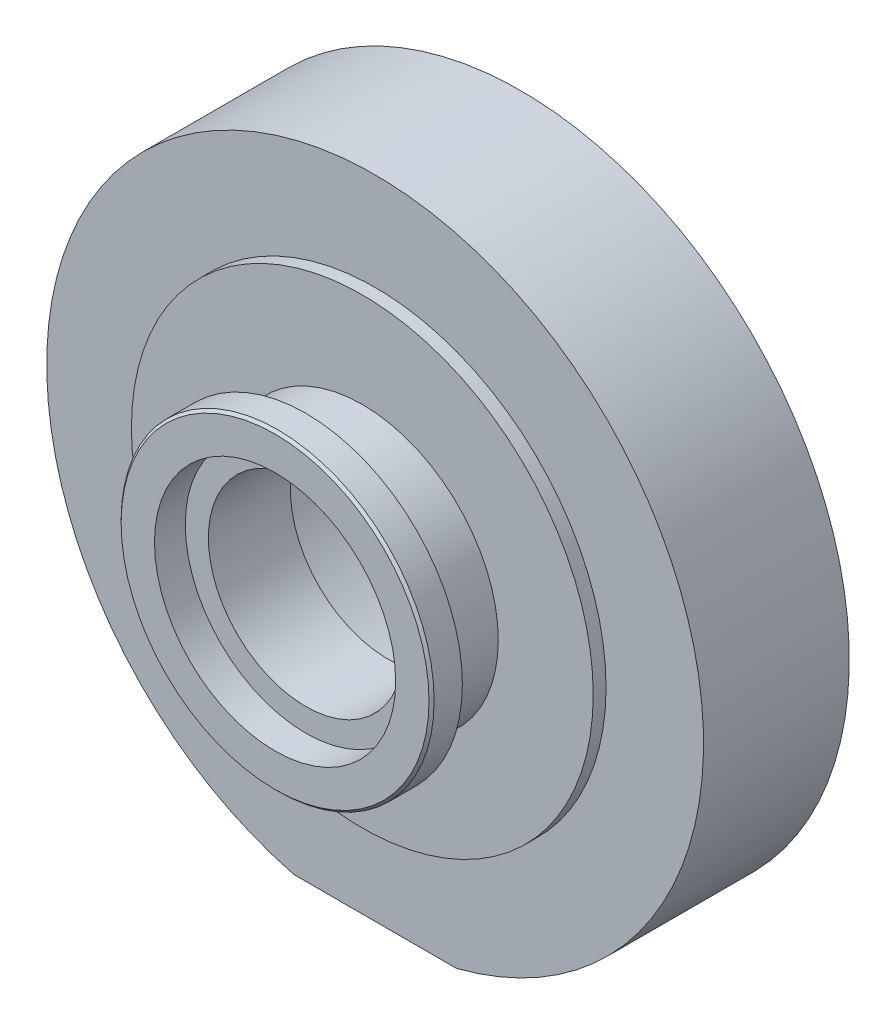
from build123d import *

# Parameters (mm, degrees)
SKIZZE2_W               = 128
SKIZZE2_H               = 30
LINEAR_AUSTRAGEN1_DEPTH = 47.9


with BuildPart() as part:
    # Skizze1 → Rotation1 (revolve)
    with BuildSketch(Plane(origin=(0, 0, 0), x_dir=(0, 0, -1), z_dir=(1, 0, 0)), mode=Mode.PRIVATE) as rotation1_sk:
        Polygon((0, 30), (0, 23.5), (6, 23.5), (6, 19), (22, 19), (22, 26), (22.5, 26), (22.5, 41), (30.5, 41), (30.5, 37), (45.4, 37), (45.4, 45), (47.9, 45), (47.9, 64), (19.5, 64), (19.5, 45), (17, 45), (17, 26.5), (6, 26.5), (6, 30.5), (0.5, 30.5), align=None)
    revolve(rotation1_sk.sketch.rotate(Axis((0, 0, -47.9), (0, 0, 1)), 270), axis=Axis((0, 0, -47.9), (0, 0, 1)))

    # Skizze2 → Linear austragen1 (cut)
    with BuildSketch(Plane.XY):
        with Locations((0, -77)):
            Rectangle(SKIZZE2_W, SKIZZE2_H)
    extrude(amount=-LINEAR_AUSTRAGEN1_DEPTH, mode=Mode.SUBTRACT)

    # Skizze3 → Schnitt-Rotation1 (revolve, cut)
    with BuildSketch(Plane.XY.offset(-32.9), mode=Mode.PRIVATE) as schnitt_rotation1_sk:
        Polygon((-21.268238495, -50.104829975), (-19.982643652, -51.810871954), (-23.303858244, -59.635163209), (-25.006792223, -58.912310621), align=None)
    revolve(schnitt_rotation1_sk.sketch.rotate(Axis((-25.006792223, -58.912310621, -32.9), (0.39073112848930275, 0.920504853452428, 0)), 180), axis=Axis((-25.006792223, -58.912310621, -32.9), (0.39073112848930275, 0.920504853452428, 0)), mode=Mode.SUBTRACT)


solid = part.part
